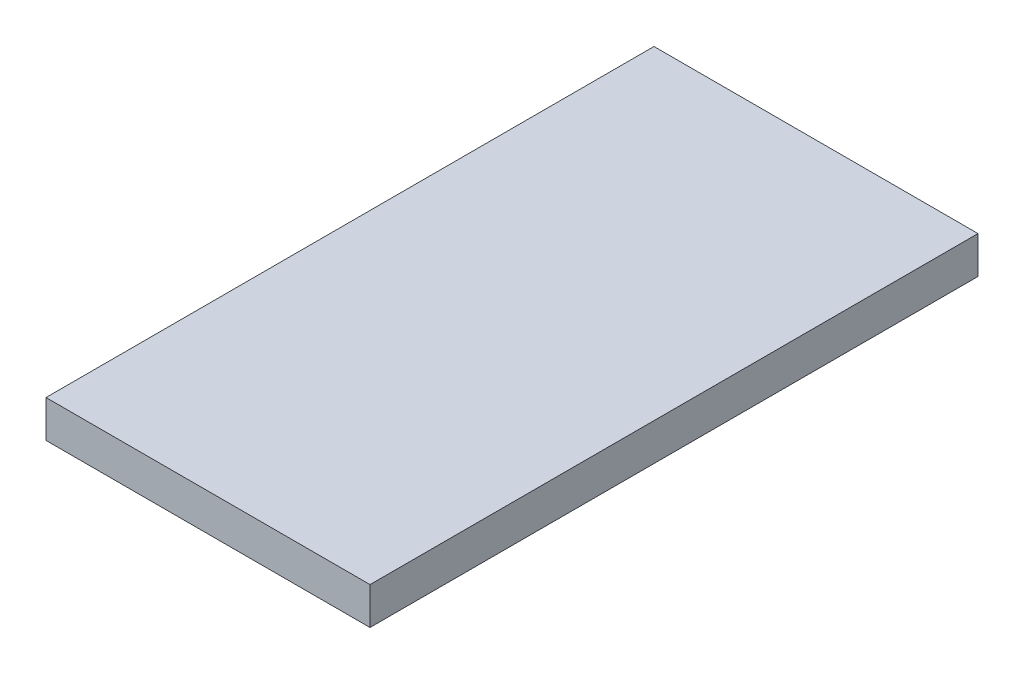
from build123d import *

# Parameters (mm, degrees)
SKETCH1_W           = 45.32
SKETCH1_H           = 85.04
BOSS_EXTRUDE1_DEPTH = 2.6


with BuildPart() as part:
    # Sketch1 → Boss-Extrude1 (new, symmetric)
    with BuildSketch(Plane(origin=(0, 0, 0), x_dir=(1, 0, 0), z_dir=(0, 1, 0))):
        Rectangle(SKETCH1_W, SKETCH1_H)
    extrude(amount=BOSS_EXTRUDE1_DEPTH, both=True)


solid = part.part
